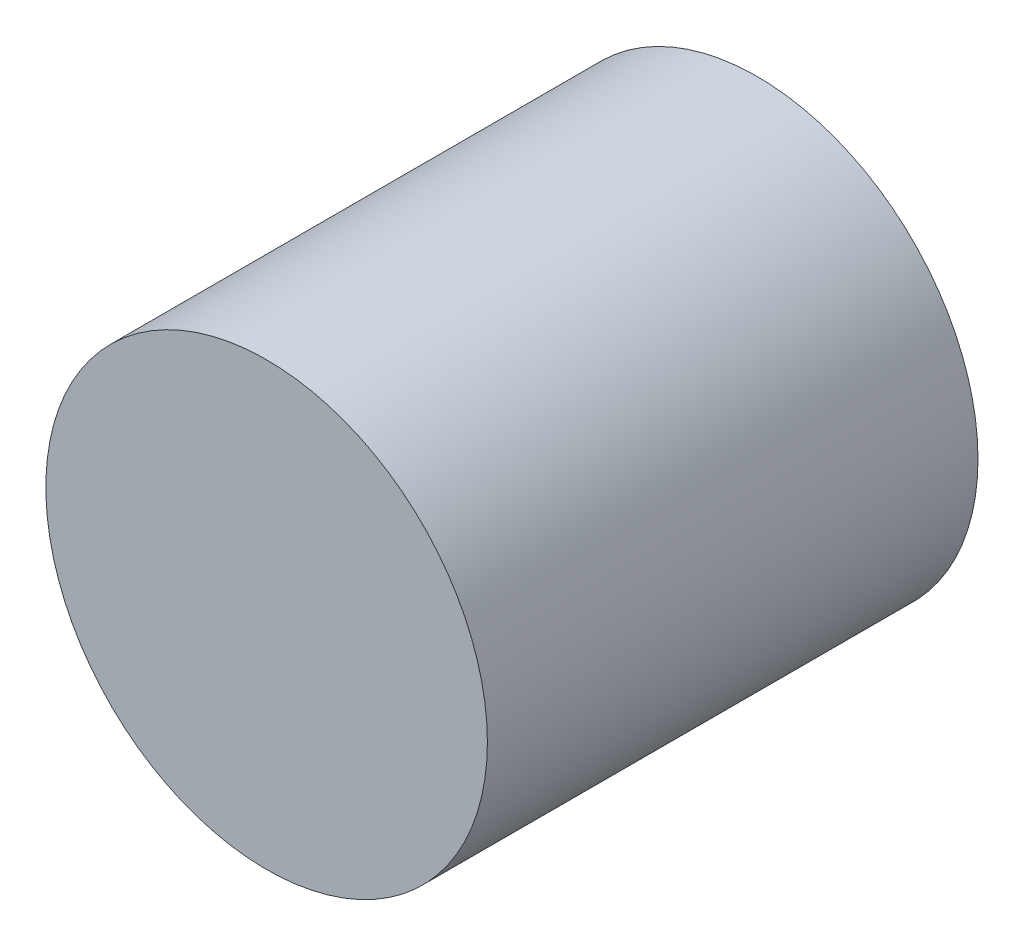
from build123d import *

# Parameters (mm, degrees)
CROQUIS1_R     = 4.5
EXTRUIR1_DEPTH = 10


with BuildPart() as part:
    # Croquis1 → Extruir1 (new body)
    with BuildSketch(Plane.XY):
        Circle(CROQUIS1_R)
    extrude(amount=EXTRUIR1_DEPTH)


solid = part.part
